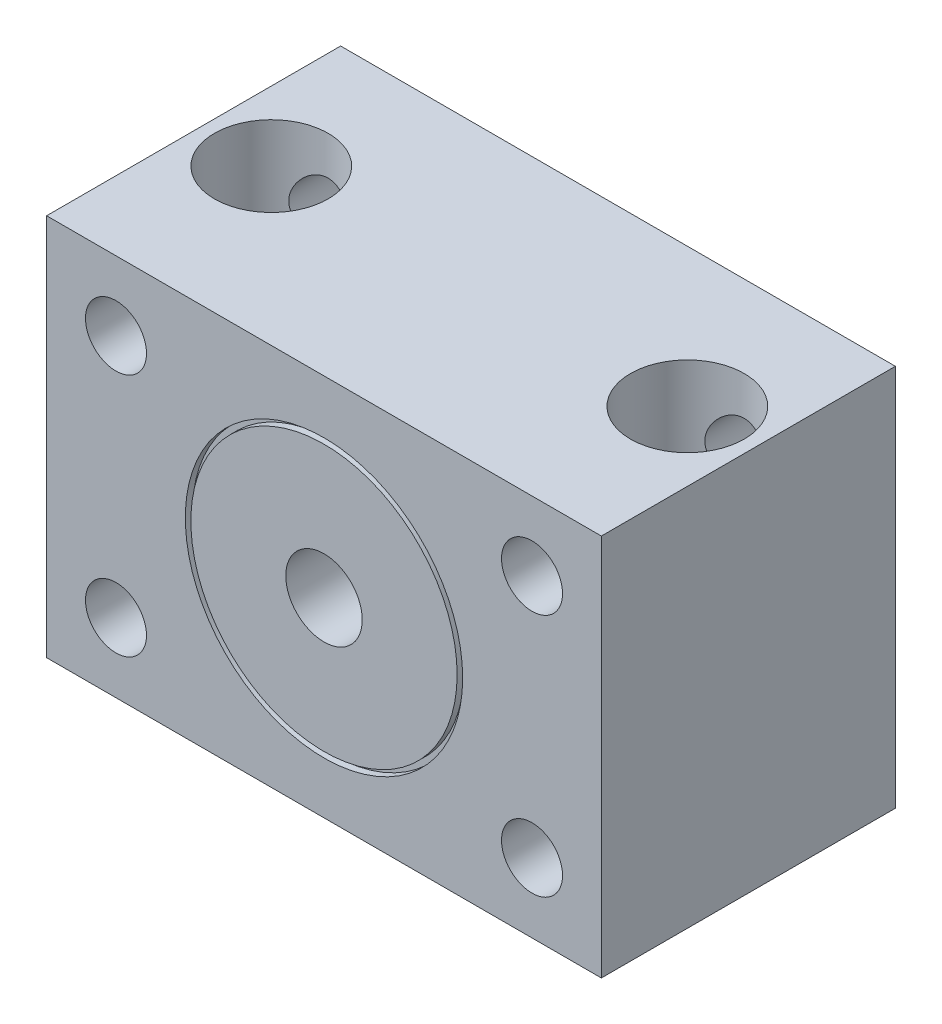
from build123d import *

# Parameters (mm, degrees)
SKETCH1_W          = 50.8
SKETCH1_H          = 26.924
EXTRUDE_B_DEPTH    = 35.052
SKETCH2_R          = 3.556
PHOLES_DEPTH       = 68.336353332
SKETCH3_R          = 5.207
PCBOREDDEPTH_DEPTH = 10.414
SKETCH4_R          = 2.794
CUT_EXTRUDE3_DEPTH = 68.336353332
SKETCH5_R          = 3.5
CUT_EXTRUDE4_DEPTH = 68.336353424
SKETCH6_R          = 12.7
SKETCH6_R_2        = 12.192
F_7_8_COVER_DEPTH  = 0.635


with BuildPart() as part:
    # Sketch1 → Extrude B (new body)
    with BuildSketch(Plane(origin=(0, 0, 0), x_dir=(1, 0, 0), z_dir=(0, 1, 0))):
        with Locations((25.4, 13.462)):
            Rectangle(SKETCH1_W, SKETCH1_H)
    extrude(amount=EXTRUDE_B_DEPTH)

    # Sketch2 → PHoles (cut, through all)
    with BuildSketch(Plane(origin=(0, 35.052, 0), x_dir=(-1, 0, 0), z_dir=(0, 1, 0))):
        with Locations(Location((-44.45, -14.224, 0), (0, 0, 90))):
            Circle(SKETCH2_R)
        with Locations(Location((-6.35, -14.224, 0), (0, 0, 90))):
            Circle(SKETCH2_R)
        with Locations((-44.45, 29.21)):
            Circle(SKETCH2_R)
        with Locations((-6.35, 29.21)):
            Circle(SKETCH2_R)
    extrude(amount=-PHOLES_DEPTH, mode=Mode.SUBTRACT)

    # Sketch3 → PcBoredDepth (cut)
    with BuildSketch(Plane(origin=(0, 35.052, 0), x_dir=(-1, 0, 0), z_dir=(0, 1, 0))):
        with Locations(Location((-6.35, -14.224, 0), (0, 0, 90))):
            Circle(SKETCH3_R)
        with Locations(Location((-44.45, -14.224, 0), (0, 0, 90))):
            Circle(SKETCH3_R)
        with Locations((-44.45, 29.21)):
            Circle(SKETCH3_R)
        with Locations((-6.35, 29.21)):
            Circle(SKETCH3_R)
    extrude(amount=-PCBOREDDEPTH_DEPTH, mode=Mode.SUBTRACT)

    # Sketch4 → Cut-Extrude3 (cut, through all)
    with BuildSketch(Plane.XY):
        with Locations((6.35, 28.702)):
            Circle(SKETCH4_R)
        with Locations((6.35, 6.35)):
            Circle(SKETCH4_R)
        with Locations((44.45, 28.702)):
            Circle(SKETCH4_R)
        with Locations((44.45, 6.35)):
            Circle(SKETCH4_R)
        with Locations((6.35, 51.054)):
            Circle(SKETCH4_R)
        with Locations((44.45, 51.054)):
            Circle(SKETCH4_R)
    extrude(amount=-CUT_EXTRUDE3_DEPTH, mode=Mode.SUBTRACT)

    # Sketch5 → Cut-Extrude4 (cut, through all)
    with BuildSketch(Plane.XY):
        with Locations((25.4, 17.4498)):
            Circle(SKETCH5_R)
    extrude(amount=-CUT_EXTRUDE4_DEPTH, mode=Mode.SUBTRACT)

    # Sketch6 → 7_8 Cover (cut)
    with BuildSketch(Plane.XY):
        with Locations((25.4, 17.4498)):
            Circle(SKETCH6_R)
        with Locations((25.4, 17.4498)):
            Circle(SKETCH6_R_2, mode=Mode.SUBTRACT)
    extrude(amount=-F_7_8_COVER_DEPTH, mode=Mode.SUBTRACT)


solid = part.part
